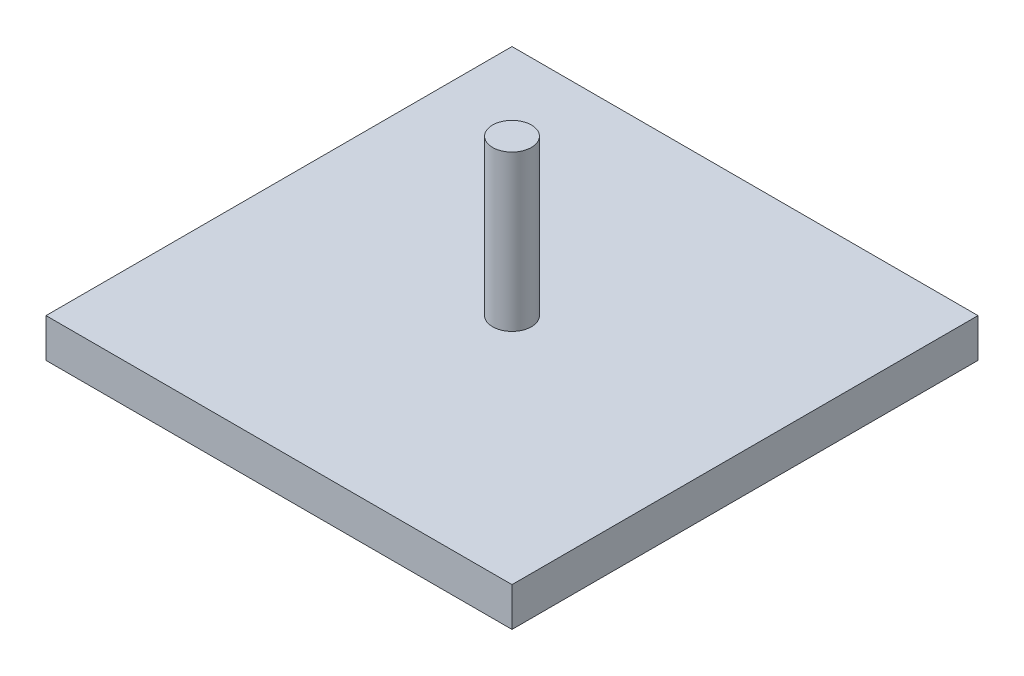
from build123d import *

# Parameters (mm, degrees)
SKETCH1_W           = 304.8
SKETCH1_H           = 304.8
BOSS_EXTRUDE1_DEPTH = 12.7
SKETCH2_R           = 12.7
BOSS_EXTRUDE2_DEPTH = 101.6


with BuildPart() as part:
    # Sketch1 → Boss-Extrude1 (new, symmetric)
    with BuildSketch(Plane(origin=(0, 0, 0), x_dir=(1, 0, 0), z_dir=(0, 1, 0))):
        Rectangle(SKETCH1_W, SKETCH1_H)
    extrude(amount=BOSS_EXTRUDE1_DEPTH, both=True)

    # Sketch2 → Boss-Extrude2 (add)
    with BuildSketch(Plane(origin=(0, 12.7, 0), x_dir=(1, 0, 0), z_dir=(0, 1, 0))):
        with Locations(Location((0, 0, 0), (0, 0, 270))):
            Circle(SKETCH2_R)
    extrude(amount=BOSS_EXTRUDE2_DEPTH)


solid = part.part
